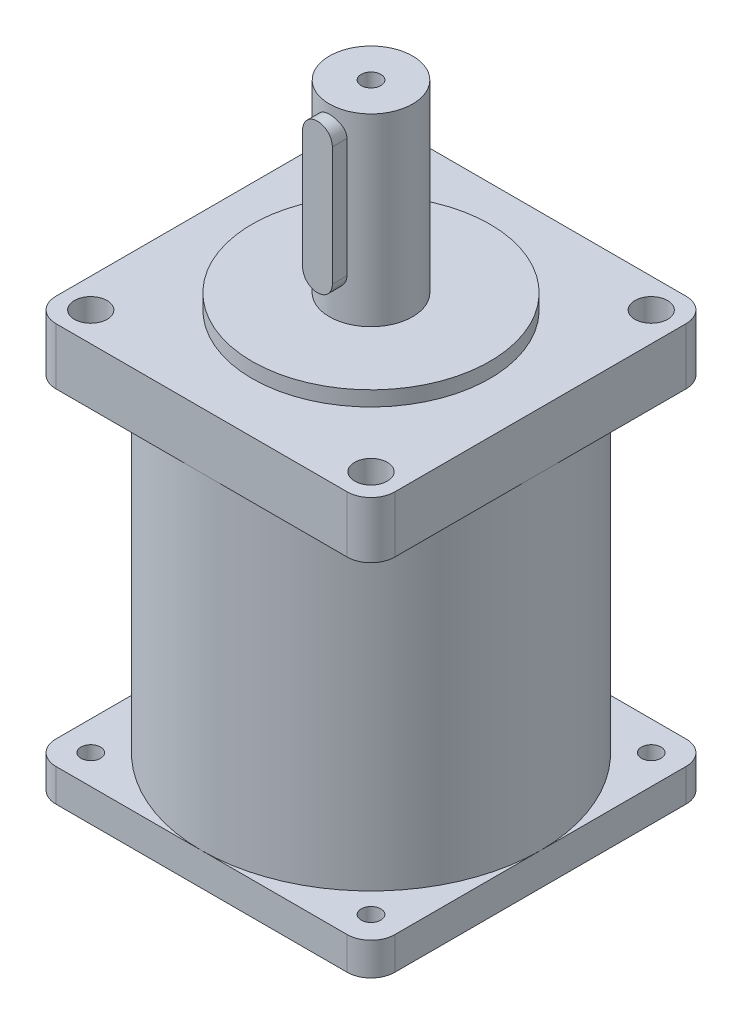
from build123d import *

# Parameters (mm, degrees)
SKETCH_1_W             = 57
SKETCH_1_H             = 57
EXTRUDE_1_DEPTH        = 9.5
SKETCH_2_R             = 20
EXTRUDE_2_DEPTH        = 2.5
SKETCH_3_R             = 7
EXTRUDE_3_DEPTH        = 33.5
SKETCH_5_R             = 2.75
CUT_EXTRUDE_1_DEPTH    = 9.5
HOLE_WIZARD_M4_1_D     = 3.3
HOLE_WIZARD_M4_1_DEPTH = 11.5
HOLE_WIZARD_M4_1_TIP   = 0.991420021
EXTRUDE_4_DEPTH        = 5
SKETCH_9_R             = 28.5
EXTRUDE_5_DEPTH        = 55
SKETCH_10_W            = 57
SKETCH_10_H            = 57
EXTRUDE_6_DEPTH        = 5.5
HOLE_WIZARD_M4_2_D     = 3.3
HOLE_WIZARD_M4_2_DEPTH = 9
HOLE_WIZARD_M4_2_TIP   = 0.991420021
FILLET_1_R             = 4
SKETCH_13_R            = 19.05
CUT_EXTRUDE_2_DEPTH    = 2.5
SKETCH_14_R            = 4
CUT_EXTRUDE_3_DEPTH    = 7


with BuildPart() as part:
    # Sketch 1 → Extrude 1 (new body)
    with BuildSketch(Plane(origin=(0, 0, 0), x_dir=(1, 0, 0), z_dir=(0, 1, 0))):
        Rectangle(SKETCH_1_W, SKETCH_1_H)
    extrude(amount=EXTRUDE_1_DEPTH)

    # Sketch 2 → Extrude 2 (add)
    with BuildSketch(Plane(origin=(0, 9.5, 0), x_dir=(1, 0, 0), z_dir=(0, 1, 0))):
        with Locations(Location((0, 0, 0), (0, 0, 270))):
            Circle(SKETCH_2_R)
    extrude(amount=EXTRUDE_2_DEPTH)

    # Sketch 3 → Extrude 3 (add)
    with BuildSketch(Plane(origin=(0, 9.5, 0), x_dir=(1, 0, 0), z_dir=(0, 1, 0))):
        with Locations(Location((0, 0, 0), (0, 0, 270))):
            Circle(SKETCH_3_R)
    extrude(amount=EXTRUDE_3_DEPTH)

    # Sketch 5 → Cut-Extrude 1 (cut)
    with BuildSketch(Plane(origin=(0, 9.5, 0), x_dir=(1, 0, 0), z_dir=(0, 1, 0))):
        with Locations(Location((-23.57, 23.57, 0), (0, 0, 270))):
            Circle(SKETCH_5_R)
        with Locations(Location((-23.57, -23.57, 0), (0, 0, 270))):
            Circle(SKETCH_5_R)
        with Locations(Location((23.57, -23.57, 0), (0, 0, 270))):
            Circle(SKETCH_5_R)
        with Locations(Location((23.57, 23.57, 0), (0, 0, 270))):
            Circle(SKETCH_5_R)
    extrude(amount=-CUT_EXTRUDE_1_DEPTH, mode=Mode.SUBTRACT)

    # Hole Wizard M4 _1
    with Locations(Plane(origin=(0, 43, 0), x_dir=(1, 0, 0), z_dir=(0, 1, 0))):
        with Locations((0, 0)):
            Hole(HOLE_WIZARD_M4_1_D / 2, depth=HOLE_WIZARD_M4_1_DEPTH)
            with Locations((0, 0, -(HOLE_WIZARD_M4_1_DEPTH + HOLE_WIZARD_M4_1_TIP / 2))):  # 118° drill point
                Cone(0, HOLE_WIZARD_M4_1_D / 2, HOLE_WIZARD_M4_1_TIP, mode=Mode.SUBTRACT)

    # Sketch 8 → Extrude 4 (add)
    with BuildSketch(Plane.XY.offset(4)):
        with BuildLine():
            Line((-2.5, 39), (-2.5, 19))
            ThreePointArc((-2.5, 19), (0, 16.5), (2.5, 19))
            Line((2.5, 19), (2.5, 39))
            ThreePointArc((2.5, 39), (0, 41.5), (-2.5, 39))
        make_face()
    extrude(amount=EXTRUDE_4_DEPTH)

    # Sketch 9 → Extrude 5 (add)
    with BuildSketch(Plane(origin=(0, 0, 0), x_dir=(1, 0, 0), z_dir=(0, 1, 0))):
        with Locations(Location((0, 0, 0), (0, 0, 270))):
            Circle(SKETCH_9_R)
    extrude(amount=-EXTRUDE_5_DEPTH)

    # Sketch 10 → Extrude 6 (add)
    with BuildSketch(Plane(origin=(0, -55, 0), x_dir=(-1, 0, 0), z_dir=(0, -1, 0))):
        Rectangle(SKETCH_10_W, SKETCH_10_H)
    extrude(amount=EXTRUDE_6_DEPTH)

    # Hole Wizard M4 _2
    with Locations(Plane(origin=(0, -55, 0), x_dir=(-1, 0, 0), z_dir=(0, 1, 0))):
        with Locations((23.57, 23.57), (23.57, -23.57), (-23.57, -23.57), (-23.57, 23.57)):
            Hole(HOLE_WIZARD_M4_2_D / 2, depth=HOLE_WIZARD_M4_2_DEPTH)
            with Locations((0, 0, -(HOLE_WIZARD_M4_2_DEPTH + HOLE_WIZARD_M4_2_TIP / 2))):  # 118° drill point
                Cone(0, HOLE_WIZARD_M4_2_D / 2, HOLE_WIZARD_M4_2_TIP, mode=Mode.SUBTRACT)

    # Fillet 1
    fillet_1_edges = [part.edges().sort_by_distance(p)[0] for p in [
        (28.5, -57.75, -28.5),
        (28.5, -57.75, 28.5),
        (-28.5, -57.75, 28.5),
        (-28.5, -57.75, -28.5),
        (28.5, 4.75, 28.5),
        (-28.5, 4.75, 28.5),
        (-28.5, 4.75, -28.5),
        (28.5, 4.75, -28.5),
    ]]
    fillet(fillet_1_edges, radius=FILLET_1_R)

    # Sketch 13 → Cut-Extrude 2 (cut)
    with BuildSketch(Plane(origin=(0, -60.5, 0), x_dir=(-1, 0, 0), z_dir=(0, -1, 0))):
        with Locations(Location((0, 0, 0), (0, 0, 90))):
            Circle(SKETCH_13_R)
    extrude(amount=-CUT_EXTRUDE_2_DEPTH, mode=Mode.SUBTRACT)

    # Sketch 14 → Cut-Extrude 3 (cut)
    with BuildSketch(Plane(origin=(0, -60.5, 0), x_dir=(-1, 0, 0), z_dir=(0, -1, 0))):
        with Locations(Location((0, 0, 0), (0, 0, 90))):
            Circle(SKETCH_14_R)
    extrude(amount=-CUT_EXTRUDE_3_DEPTH, mode=Mode.SUBTRACT)


solid = part.part
